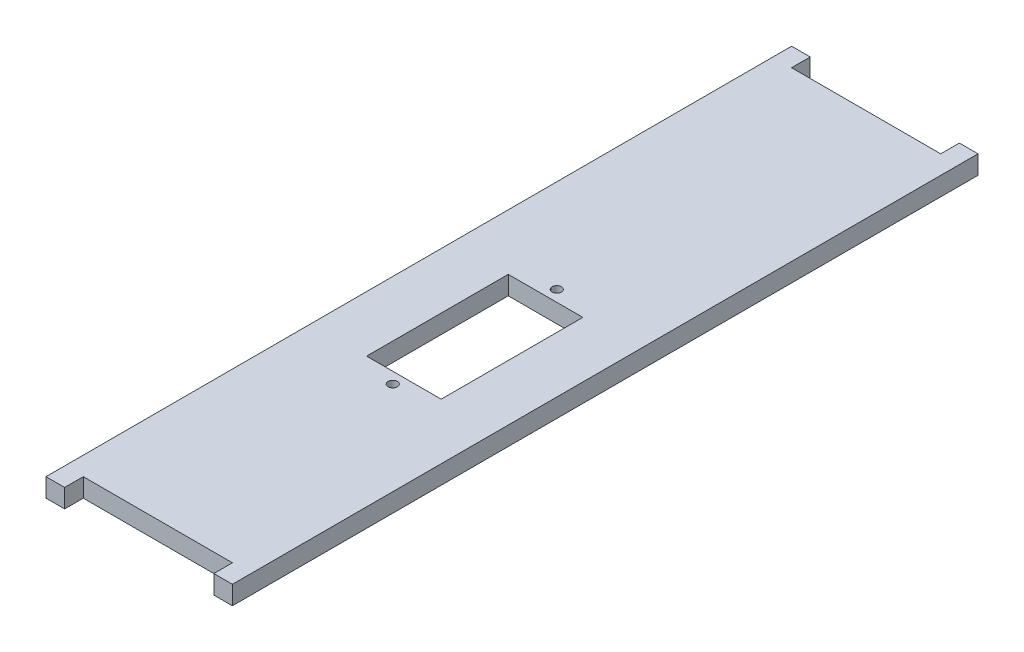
from build123d import *

# Parameters (mm, degrees)
SKETCH1_W                          = 31.75
SKETCH1_H                          = 127
BOSS_EXTRUDE1_DEPTH                = 1.5875
SKETCH2_W                          = 25.4
SKETCH2_H                          = 3.175
CUT_EXTRUDE1_DEPTH                 = 66.531261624
SKETCH3_W                          = 12.7
SKETCH3_H                          = 24.13
CUT_EXTRUDE2_DEPTH                 = 66.531261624
F_1_16_0_0625_DIAMETER_HOLE1_D     = 1.5875
F_1_16_0_0625_DIAMETER_HOLE1_DEPTH = 3.302
F_1_16_0_0625_DIAMETER_HOLE1_TIP   = 0.476933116


with BuildPart() as part:
    # Sketch1 → Boss-Extrude1 (new, symmetric)
    with BuildSketch(Plane(origin=(0, 0, 0), x_dir=(1, 0, 0), z_dir=(0, 1, 0))):
        Rectangle(SKETCH1_W, SKETCH1_H)
    extrude(amount=BOSS_EXTRUDE1_DEPTH, both=True)

    # Sketch2 → Cut-Extrude1 (cut, through all)
    with BuildSketch(Plane(origin=(0, 1.5875, 0), x_dir=(1, 0, 0), z_dir=(0, 1, 0))):
        with Locations((0, -61.9125)):
            Rectangle(SKETCH2_W, SKETCH2_H)
        with Locations((0, 61.9125)):
            Rectangle(SKETCH2_W, SKETCH2_H)
    extrude(amount=-CUT_EXTRUDE1_DEPTH, mode=Mode.SUBTRACT)

    # Sketch3 → Cut-Extrude2 (cut, through all)
    with BuildSketch(Plane(origin=(0, 1.5875, 0), x_dir=(1, 0, 0), z_dir=(0, 1, 0))):
        with Locations((0, -6.35)):
            Rectangle(SKETCH3_W, SKETCH3_H)
    extrude(amount=-CUT_EXTRUDE2_DEPTH, mode=Mode.SUBTRACT)

    # 1_16 _0.0625_ Diameter Hole1
    with Locations(Plane(origin=(0, 1.5875, 0), x_dir=(-1, 0, 0), z_dir=(0, 1, 0))):
        with Locations((0, 20.32), (0, -7.62)):
            Hole(F_1_16_0_0625_DIAMETER_HOLE1_D / 2, depth=F_1_16_0_0625_DIAMETER_HOLE1_DEPTH)
            with Locations((0, 0, -(F_1_16_0_0625_DIAMETER_HOLE1_DEPTH + F_1_16_0_0625_DIAMETER_HOLE1_TIP / 2))):  # 118° drill point
                Cone(0, F_1_16_0_0625_DIAMETER_HOLE1_D / 2, F_1_16_0_0625_DIAMETER_HOLE1_TIP, mode=Mode.SUBTRACT)


solid = part.part
